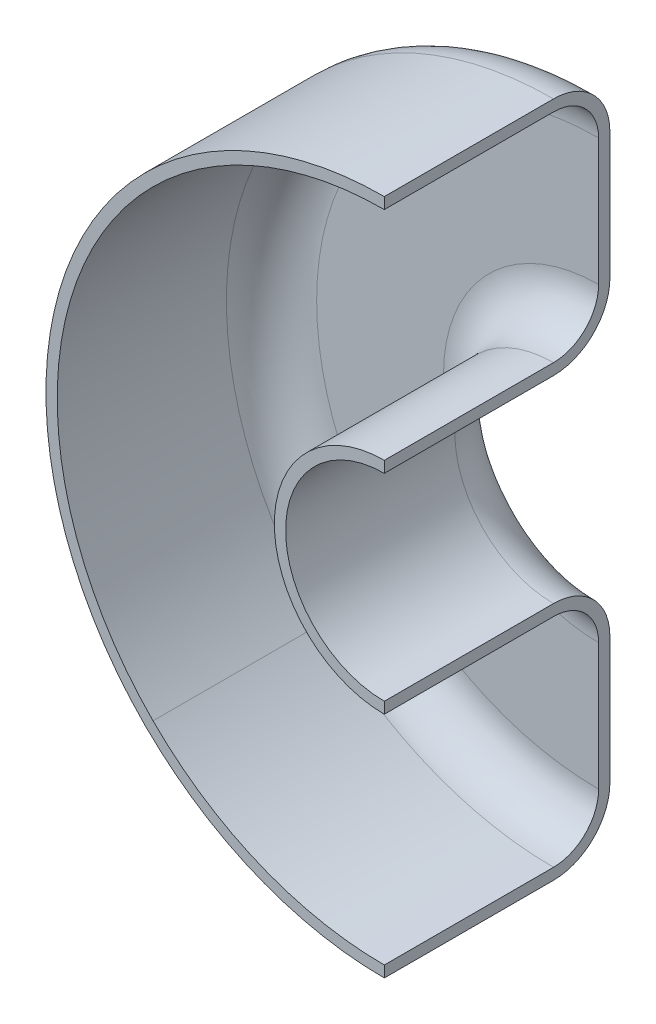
ISO-10303-21;
HEADER;
FILE_DESCRIPTION(('STEP AP214'),'2;1');
FILE_NAME('part.step','',(''),(''),'','','');
FILE_SCHEMA(('AUTOMOTIVE_DESIGN { 1 0 10303 214 1 1 1 1 }'));
ENDSEC;
DATA;
#1=APPLICATION_CONTEXT('core data for automotive mechanical design processes');
#2=APPLICATION_PROTOCOL_DEFINITION('international standard','automotive_design',2000,#1);
#3=PRODUCT_CONTEXT('',#1,'mechanical');
#4=PRODUCT('Part','Part','',(#3));
#5=PRODUCT_RELATED_PRODUCT_CATEGORY('part','',(#4));
#6=PRODUCT_DEFINITION_FORMATION('','',#4);
#7=PRODUCT_DEFINITION_CONTEXT('part definition',#1,'design');
#8=PRODUCT_DEFINITION('design','',#6,#7);
#9=PRODUCT_DEFINITION_SHAPE('','',#8);
#10=(LENGTH_UNIT() NAMED_UNIT(*) SI_UNIT(.MILLI.,.METRE.));
#11=(NAMED_UNIT(*) PLANE_ANGLE_UNIT() SI_UNIT($,.RADIAN.));
#12=(NAMED_UNIT(*) SI_UNIT($,.STERADIAN.) SOLID_ANGLE_UNIT());
#13=UNCERTAINTY_MEASURE_WITH_UNIT(LENGTH_MEASURE(1.E-05),#10,'distance_accuracy_value','');
#14=(GEOMETRIC_REPRESENTATION_CONTEXT(3) GLOBAL_UNCERTAINTY_ASSIGNED_CONTEXT((#13)) GLOBAL_UNIT_ASSIGNED_CONTEXT((#10,
#11,#12)) REPRESENTATION_CONTEXT('',''));
#15=CARTESIAN_POINT('',(0.,0.,0.));
#16=DIRECTION('',(0.,0.,1.));
#17=DIRECTION('',(1.,0.,0.));
#18=AXIS2_PLACEMENT_3D('',#15,#16,#17);
#19=CARTESIAN_POINT('',(0.,0.,40.));
#20=DIRECTION('',(0.,0.,-1.));
#21=DIRECTION('',(-1.,0.,0.));
#22=AXIS2_PLACEMENT_3D('',#19,#20,#21);
#23=CYLINDRICAL_SURFACE('',#22,59.);
#24=DIRECTION('',(0.,0.,-1.));
#25=VECTOR('',#24,1.);
#26=CARTESIAN_POINT('',(-41.7193000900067,-41.7193000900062,40.));
#27=LINE('',#26,#25);
#28=CARTESIAN_POINT('',(-41.7193000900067,-41.7193000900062,10.));
#29=VERTEX_POINT('',#28);
#30=CARTESIAN_POINT('',(-41.7193000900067,-41.7193000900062,40.));
#31=VERTEX_POINT('',#30);
#32=EDGE_CURVE('E13',#29,#31,#27,.F.);
#33=ORIENTED_EDGE('',*,*,#32,.F.);
#34=CARTESIAN_POINT('',(0.,0.,10.));
#35=DIRECTION('',(0.,0.,-1.));
#36=DIRECTION('',(-1.,0.,0.));
#37=AXIS2_PLACEMENT_3D('',#34,#35,#36);
#38=CIRCLE('',#37,59.);
#39=CARTESIAN_POINT('',(-41.719300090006,41.7193000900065,10.));
#40=VERTEX_POINT('',#39);
#41=EDGE_CURVE('E130',#29,#40,#38,.T.);
#42=ORIENTED_EDGE('',*,*,#41,.T.);
#43=DIRECTION('',(0.,0.,-1.));
#44=VECTOR('',#43,1.);
#45=CARTESIAN_POINT('',(-41.719300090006,41.7193000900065,40.));
#46=LINE('',#45,#44);
#47=CARTESIAN_POINT('',(-41.719300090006,41.7193000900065,40.));
#48=VERTEX_POINT('',#47);
#49=EDGE_CURVE('E215',#40,#48,#46,.F.);
#50=ORIENTED_EDGE('',*,*,#49,.T.);
#51=CARTESIAN_POINT('',(0.,0.,40.));
#52=DIRECTION('',(0.,0.,1.));
#53=DIRECTION('',(1.,0.,0.));
#54=AXIS2_PLACEMENT_3D('',#51,#52,#53);
#55=CIRCLE('',#54,59.);
#56=EDGE_CURVE('E60',#48,#31,#55,.T.);
#57=ORIENTED_EDGE('',*,*,#56,.T.);
#58=EDGE_LOOP('',(#33,#42,#50,#57));
#59=FACE_BOUND('',#58,.T.);
#60=ADVANCED_FACE('F52',(#59),#23,.F.);
#61=CARTESIAN_POINT('',(0.,0.,40.));
#62=DIRECTION('',(0.,0.,-1.));
#63=DIRECTION('',(-1.,0.,0.));
#64=AXIS2_PLACEMENT_3D('',#61,#62,#63);
#65=CYLINDRICAL_SURFACE('',#64,59.);
#66=DIRECTION('',(0.,0.,-1.));
#67=VECTOR('',#66,1.);
#68=CARTESIAN_POINT('',(1.31838984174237E-13,-59.,40.));
#69=LINE('',#68,#67);
#70=CARTESIAN_POINT('',(1.31838984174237E-13,-59.,40.));
#71=VERTEX_POINT('',#70);
#72=CARTESIAN_POINT('',(0.,-59.,10.));
#73=VERTEX_POINT('',#72);
#74=EDGE_CURVE('E119',#71,#73,#69,.T.);
#75=ORIENTED_EDGE('',*,*,#74,.T.);
#76=CARTESIAN_POINT('',(0.,0.,10.));
#77=DIRECTION('',(0.,0.,-1.));
#78=DIRECTION('',(-1.,0.,0.));
#79=AXIS2_PLACEMENT_3D('',#76,#77,#78);
#80=CIRCLE('',#79,59.);
#81=EDGE_CURVE('E125',#73,#29,#80,.T.);
#82=ORIENTED_EDGE('',*,*,#81,.T.);
#83=ORIENTED_EDGE('',*,*,#32,.T.);
#84=CARTESIAN_POINT('',(0.,0.,40.));
#85=DIRECTION('',(0.,0.,1.));
#86=DIRECTION('',(1.,0.,0.));
#87=AXIS2_PLACEMENT_3D('',#84,#85,#86);
#88=CIRCLE('',#87,59.);
#89=EDGE_CURVE('E116',#31,#71,#88,.T.);
#90=ORIENTED_EDGE('',*,*,#89,.T.);
#91=EDGE_LOOP('',(#75,#82,#83,#90));
#92=FACE_BOUND('',#91,.T.);
#93=ADVANCED_FACE('F118',(#92),#65,.F.);
#94=CARTESIAN_POINT('',(0.,0.,40.));
#95=DIRECTION('',(0.,0.,-1.));
#96=DIRECTION('',(-1.,0.,0.));
#97=AXIS2_PLACEMENT_3D('',#94,#95,#96);
#98=CYLINDRICAL_SURFACE('',#97,59.);
#99=DIRECTION('',(0.,0.,-1.));
#100=VECTOR('',#99,1.);
#101=CARTESIAN_POINT('',(0.,59.,10.));
#102=LINE('',#101,#100);
#103=CARTESIAN_POINT('',(0.,59.,10.));
#104=VERTEX_POINT('',#103);
#105=CARTESIAN_POINT('',(1.31838984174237E-13,59.,40.));
#106=VERTEX_POINT('',#105);
#107=EDGE_CURVE('E137',#104,#106,#102,.F.);
#108=ORIENTED_EDGE('',*,*,#107,.T.);
#109=CARTESIAN_POINT('',(0.,0.,40.));
#110=DIRECTION('',(0.,0.,1.));
#111=DIRECTION('',(1.,0.,0.));
#112=AXIS2_PLACEMENT_3D('',#109,#110,#111);
#113=CIRCLE('',#112,59.);
#114=EDGE_CURVE('E122',#106,#48,#113,.T.);
#115=ORIENTED_EDGE('',*,*,#114,.T.);
#116=ORIENTED_EDGE('',*,*,#49,.F.);
#117=CARTESIAN_POINT('',(0.,0.,10.));
#118=DIRECTION('',(0.,0.,-1.));
#119=DIRECTION('',(-1.,0.,0.));
#120=AXIS2_PLACEMENT_3D('',#117,#118,#119);
#121=CIRCLE('',#120,59.);
#122=EDGE_CURVE('E204',#40,#104,#121,.T.);
#123=ORIENTED_EDGE('',*,*,#122,.T.);
#124=EDGE_LOOP('',(#108,#115,#116,#123));
#125=FACE_BOUND('',#124,.T.);
#126=ADVANCED_FACE('F244',(#125),#98,.F.);
#127=CARTESIAN_POINT('',(0.,0.,10.));
#128=DIRECTION('',(0.,0.,1.));
#129=DIRECTION('',(1.,0.,0.));
#130=AXIS2_PLACEMENT_3D('',#127,#128,#129);
#131=TOROIDAL_SURFACE('',#130,50.,9.);
#132=CARTESIAN_POINT('',(0.,0.,1.));
#133=DIRECTION('',(0.,0.,1.));
#134=DIRECTION('',(1.,0.,0.));
#135=AXIS2_PLACEMENT_3D('',#132,#133,#134);
#136=CIRCLE('',#135,50.);
#137=CARTESIAN_POINT('',(0.,50.,1.));
#138=VERTEX_POINT('',#137);
#139=CARTESIAN_POINT('',(0.,-50.,1.));
#140=VERTEX_POINT('',#139);
#141=EDGE_CURVE('E200',#138,#140,#136,.T.);
#142=ORIENTED_EDGE('',*,*,#141,.F.);
#143=CARTESIAN_POINT('',(0.,50.,10.));
#144=DIRECTION('',(1.,0.,0.));
#145=DIRECTION('',(0.,0.,-1.));
#146=AXIS2_PLACEMENT_3D('',#143,#144,#145);
#147=CIRCLE('',#146,9.);
#148=EDGE_CURVE('E167',#104,#138,#147,.F.);
#149=ORIENTED_EDGE('',*,*,#148,.F.);
#150=ORIENTED_EDGE('',*,*,#122,.F.);
#151=ORIENTED_EDGE('',*,*,#41,.F.);
#152=ORIENTED_EDGE('',*,*,#81,.F.);
#153=CARTESIAN_POINT('',(0.,-50.,10.));
#154=DIRECTION('',(1.,0.,0.));
#155=DIRECTION('',(0.,0.,-1.));
#156=AXIS2_PLACEMENT_3D('',#153,#154,#155);
#157=CIRCLE('',#156,9.);
#158=EDGE_CURVE('E135',#140,#73,#157,.F.);
#159=ORIENTED_EDGE('',*,*,#158,.F.);
#160=EDGE_LOOP('',(#142,#149,#150,#151,#152,#159));
#161=FACE_BOUND('',#160,.T.);
#162=ADVANCED_FACE('F238',(#161),#131,.F.);
#163=CARTESIAN_POINT('',(0.,0.,1.));
#164=DIRECTION('',(0.,0.,1.));
#165=DIRECTION('',(1.,0.,0.));
#166=AXIS2_PLACEMENT_3D('',#163,#164,#165);
#167=PLANE('',#166);
#168=CARTESIAN_POINT('',(0.,0.,1.));
#169=DIRECTION('',(0.,0.,1.));
#170=DIRECTION('',(1.,0.,0.));
#171=AXIS2_PLACEMENT_3D('',#168,#169,#170);
#172=CIRCLE('',#171,27.5);
#173=CARTESIAN_POINT('',(0.,27.5,1.));
#174=VERTEX_POINT('',#173);
#175=CARTESIAN_POINT('',(0.,-27.5,1.));
#176=VERTEX_POINT('',#175);
#177=EDGE_CURVE('E161',#174,#176,#172,.T.);
#178=ORIENTED_EDGE('',*,*,#177,.F.);
#179=DIRECTION('',(0.,1.,0.));
#180=VECTOR('',#179,1.);
#181=CARTESIAN_POINT('',(0.,0.,1.));
#182=LINE('',#181,#180);
#183=EDGE_CURVE('E162',#174,#138,#182,.T.);
#184=ORIENTED_EDGE('',*,*,#183,.T.);
#185=ORIENTED_EDGE('',*,*,#141,.T.);
#186=DIRECTION('',(0.,1.,0.));
#187=VECTOR('',#186,1.);
#188=CARTESIAN_POINT('',(0.,0.,1.));
#189=LINE('',#188,#187);
#190=EDGE_CURVE('E157',#140,#176,#189,.T.);
#191=ORIENTED_EDGE('',*,*,#190,.T.);
#192=EDGE_LOOP('',(#178,#184,#185,#191));
#193=FACE_BOUND('',#192,.T.);
#194=ADVANCED_FACE('F234',(#193),#167,.T.);
#195=CARTESIAN_POINT('',(0.,0.,10.));
#196=DIRECTION('',(0.,0.,1.));
#197=DIRECTION('',(1.,0.,0.));
#198=AXIS2_PLACEMENT_3D('',#195,#196,#197);
#199=TOROIDAL_SURFACE('',#198,27.5,9.);
#200=CARTESIAN_POINT('',(0.,0.,10.));
#201=DIRECTION('',(0.,0.,1.));
#202=DIRECTION('',(1.,0.,0.));
#203=AXIS2_PLACEMENT_3D('',#200,#201,#202);
#204=CIRCLE('',#203,18.5);
#205=CARTESIAN_POINT('',(0.,18.5,10.));
#206=VERTEX_POINT('',#205);
#207=CARTESIAN_POINT('',(0.,-18.5,10.));
#208=VERTEX_POINT('',#207);
#209=EDGE_CURVE('E55',#206,#208,#204,.T.);
#210=ORIENTED_EDGE('',*,*,#209,.F.);
#211=CARTESIAN_POINT('',(0.,27.5,10.));
#212=DIRECTION('',(1.,0.,0.));
#213=DIRECTION('',(0.,0.,-1.));
#214=AXIS2_PLACEMENT_3D('',#211,#212,#213);
#215=CIRCLE('',#214,9.);
#216=EDGE_CURVE('E152',#174,#206,#215,.F.);
#217=ORIENTED_EDGE('',*,*,#216,.F.);
#218=ORIENTED_EDGE('',*,*,#177,.T.);
#219=CARTESIAN_POINT('',(0.,-27.5,10.));
#220=DIRECTION('',(1.,0.,0.));
#221=DIRECTION('',(0.,0.,-1.));
#222=AXIS2_PLACEMENT_3D('',#219,#220,#221);
#223=CIRCLE('',#222,9.);
#224=EDGE_CURVE('E172',#208,#176,#223,.F.);
#225=ORIENTED_EDGE('',*,*,#224,.F.);
#226=EDGE_LOOP('',(#210,#217,#218,#225));
#227=FACE_BOUND('',#226,.T.);
#228=ADVANCED_FACE('F230',(#227),#199,.F.);
#229=CARTESIAN_POINT('',(0.,0.,0.));
#230=DIRECTION('',(0.,0.,1.));
#231=DIRECTION('',(1.,0.,0.));
#232=AXIS2_PLACEMENT_3D('',#229,#230,#231);
#233=CYLINDRICAL_SURFACE('',#232,18.5);
#234=ORIENTED_EDGE('',*,*,#209,.T.);
#235=DIRECTION('',(0.,0.,1.));
#236=VECTOR('',#235,1.);
#237=CARTESIAN_POINT('',(0.,-18.5,10.));
#238=LINE('',#237,#236);
#239=CARTESIAN_POINT('',(1.31838984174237E-13,-18.5,40.));
#240=VERTEX_POINT('',#239);
#241=EDGE_CURVE('E148',#208,#240,#238,.T.);
#242=ORIENTED_EDGE('',*,*,#241,.T.);
#243=CARTESIAN_POINT('',(0.,0.,40.));
#244=DIRECTION('',(0.,0.,1.));
#245=DIRECTION('',(1.,0.,0.));
#246=AXIS2_PLACEMENT_3D('',#243,#244,#245);
#247=CIRCLE('',#246,18.5);
#248=CARTESIAN_POINT('',(1.31838984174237E-13,18.5,40.));
#249=VERTEX_POINT('',#248);
#250=EDGE_CURVE('E111',#240,#249,#247,.F.);
#251=ORIENTED_EDGE('',*,*,#250,.T.);
#252=DIRECTION('',(0.,0.,1.));
#253=VECTOR('',#252,1.);
#254=CARTESIAN_POINT('',(1.31838984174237E-13,18.5,40.));
#255=LINE('',#254,#253);
#256=EDGE_CURVE('E106',#249,#206,#255,.F.);
#257=ORIENTED_EDGE('',*,*,#256,.T.);
#258=EDGE_LOOP('',(#234,#242,#251,#257));
#259=FACE_BOUND('',#258,.T.);
#260=ADVANCED_FACE('F53',(#259),#233,.T.);
#261=OPEN_SHELL('',(#60,#93,#126,#162,#194,#228,#260));
#262=SHELL_BASED_SURFACE_MODEL('B2',(#261));
#263=CARTESIAN_POINT('',(0.,0.,40.));
#264=DIRECTION('',(0.,0.,-1.));
#265=DIRECTION('',(-1.,0.,0.));
#266=AXIS2_PLACEMENT_3D('',#263,#264,#265);
#267=CYLINDRICAL_SURFACE('',#266,58.);
#268=CARTESIAN_POINT('',(0.,0.,40.));
#269=DIRECTION('',(0.,0.,1.));
#270=DIRECTION('',(1.,0.,0.));
#271=AXIS2_PLACEMENT_3D('',#268,#269,#270);
#272=CIRCLE('',#271,58.);
#273=CARTESIAN_POINT('',(-41.0121933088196,-41.0121933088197,40.));
#274=VERTEX_POINT('',#273);
#275=CARTESIAN_POINT('',(1.31838984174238E-13,-58.,40.));
#276=VERTEX_POINT('',#275);
#277=EDGE_CURVE('E457',#274,#276,#272,.T.);
#278=ORIENTED_EDGE('',*,*,#277,.T.);
#279=DIRECTION('',(0.,0.,-1.));
#280=VECTOR('',#279,1.);
#281=CARTESIAN_POINT('',(1.31838984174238E-13,-58.,40.));
#282=LINE('',#281,#280);
#283=CARTESIAN_POINT('',(0.,-58.,10.));
#284=VERTEX_POINT('',#283);
#285=EDGE_CURVE('E455',#276,#284,#282,.T.);
#286=ORIENTED_EDGE('',*,*,#285,.T.);
#287=CARTESIAN_POINT('',(0.,0.,10.));
#288=DIRECTION('',(0.,0.,-1.));
#289=DIRECTION('',(-1.,0.,0.));
#290=AXIS2_PLACEMENT_3D('',#287,#288,#289);
#291=CIRCLE('',#290,58.);
#292=CARTESIAN_POINT('',(-41.0121933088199,-41.0121933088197,10.));
#293=VERTEX_POINT('',#292);
#294=EDGE_CURVE('E440',#293,#284,#291,.F.);
#295=ORIENTED_EDGE('',*,*,#294,.F.);
#296=DIRECTION('',(0.,0.,-1.));
#297=VECTOR('',#296,1.);
#298=CARTESIAN_POINT('',(-41.0121933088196,-41.0121933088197,40.));
#299=LINE('',#298,#297);
#300=EDGE_CURVE('E475',#293,#274,#299,.F.);
#301=ORIENTED_EDGE('',*,*,#300,.T.);
#302=EDGE_LOOP('',(#278,#286,#295,#301));
#303=FACE_BOUND('',#302,.T.);
#304=ADVANCED_FACE('F325',(#303),#267,.F.);
#305=CARTESIAN_POINT('',(0.,0.,40.));
#306=DIRECTION('',(0.,0.,-1.));
#307=DIRECTION('',(-1.,0.,0.));
#308=AXIS2_PLACEMENT_3D('',#305,#306,#307);
#309=CYLINDRICAL_SURFACE('',#308,60.);
#310=DIRECTION('',(0.,0.,-1.));
#311=VECTOR('',#310,1.);
#312=CARTESIAN_POINT('',(1.31838984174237E-13,-60.,40.));
#313=LINE('',#312,#311);
#314=CARTESIAN_POINT('',(1.31838984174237E-13,-60.,40.));
#315=VERTEX_POINT('',#314);
#316=CARTESIAN_POINT('',(0.,-60.,10.));
#317=VERTEX_POINT('',#316);
#318=EDGE_CURVE('E340',#315,#317,#313,.T.);
#319=ORIENTED_EDGE('',*,*,#318,.F.);
#320=CARTESIAN_POINT('',(0.,0.,40.));
#321=DIRECTION('',(0.,0.,1.));
#322=DIRECTION('',(1.,0.,0.));
#323=AXIS2_PLACEMENT_3D('',#320,#321,#322);
#324=CIRCLE('',#323,60.);
#325=CARTESIAN_POINT('',(-42.4264068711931,-42.4264068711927,40.));
#326=VERTEX_POINT('',#325);
#327=EDGE_CURVE('E499',#326,#315,#324,.T.);
#328=ORIENTED_EDGE('',*,*,#327,.F.);
#329=DIRECTION('',(0.,0.,-1.));
#330=VECTOR('',#329,1.);
#331=CARTESIAN_POINT('',(-42.4264068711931,-42.4264068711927,40.));
#332=LINE('',#331,#330);
#333=CARTESIAN_POINT('',(-42.4264068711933,-42.4264068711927,10.));
#334=VERTEX_POINT('',#333);
#335=EDGE_CURVE('E477',#334,#326,#332,.F.);
#336=ORIENTED_EDGE('',*,*,#335,.F.);
#337=CARTESIAN_POINT('',(0.,0.,10.));
#338=DIRECTION('',(0.,0.,1.));
#339=DIRECTION('',(1.,0.,0.));
#340=AXIS2_PLACEMENT_3D('',#337,#338,#339);
#341=CIRCLE('',#340,60.);
#342=EDGE_CURVE('E486',#334,#317,#341,.T.);
#343=ORIENTED_EDGE('',*,*,#342,.T.);
#344=EDGE_LOOP('',(#319,#328,#336,#343));
#345=FACE_BOUND('',#344,.T.);
#346=ADVANCED_FACE('F556',(#345),#309,.T.);
#347=CARTESIAN_POINT('',(0.,0.,40.));
#348=DIRECTION('',(0.,0.,1.));
#349=DIRECTION('',(1.,0.,0.));
#350=AXIS2_PLACEMENT_3D('',#347,#348,#349);
#351=PLANE('',#350);
#352=CARTESIAN_POINT('',(0.,0.,40.));
#353=DIRECTION('',(0.,0.,1.));
#354=DIRECTION('',(1.,0.,0.));
#355=AXIS2_PLACEMENT_3D('',#352,#353,#354);
#356=CIRCLE('',#355,19.5);
#357=CARTESIAN_POINT('',(0.,19.5,40.));
#358=VERTEX_POINT('',#357);
#359=CARTESIAN_POINT('',(0.,-19.5,40.));
#360=VERTEX_POINT('',#359);
#361=EDGE_CURVE('E503',#358,#360,#356,.T.);
#362=ORIENTED_EDGE('',*,*,#361,.T.);
#363=DIRECTION('',(0.,-1.,0.));
#364=VECTOR('',#363,1.);
#365=CARTESIAN_POINT('',(1.31838984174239E-13,269.210188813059,40.));
#366=LINE('',#365,#364);
#367=CARTESIAN_POINT('',(0.,-17.5,40.));
#368=VERTEX_POINT('',#367);
#369=EDGE_CURVE('E558',#368,#360,#366,.T.);
#370=ORIENTED_EDGE('',*,*,#369,.F.);
#371=CARTESIAN_POINT('',(0.,0.,40.));
#372=DIRECTION('',(0.,0.,1.));
#373=DIRECTION('',(1.,0.,0.));
#374=AXIS2_PLACEMENT_3D('',#371,#372,#373);
#375=CIRCLE('',#374,17.5);
#376=CARTESIAN_POINT('',(0.,17.5,40.));
#377=VERTEX_POINT('',#376);
#378=EDGE_CURVE('E450',#377,#368,#375,.T.);
#379=ORIENTED_EDGE('',*,*,#378,.F.);
#380=EDGE_CURVE('E562',#358,#377,#366,.T.);
#381=ORIENTED_EDGE('',*,*,#380,.F.);
#382=EDGE_LOOP('',(#362,#370,#379,#381));
#383=FACE_BOUND('',#382,.T.);
#384=ADVANCED_FACE('F575',(#383),#351,.T.);
#385=DIRECTION('',(0.,0.,-1.));
#386=VECTOR('',#385,1.);
#387=CARTESIAN_POINT('',(1.31838984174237E-13,60.,40.));
#388=LINE('',#387,#386);
#389=CARTESIAN_POINT('',(0.,60.,10.));
#390=VERTEX_POINT('',#389);
#391=CARTESIAN_POINT('',(1.31838984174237E-13,60.,40.));
#392=VERTEX_POINT('',#391);
#393=EDGE_CURVE('E518',#390,#392,#388,.F.);
#394=ORIENTED_EDGE('',*,*,#393,.F.);
#395=CARTESIAN_POINT('',(-42.4264068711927,42.4264068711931,10.));
#396=VERTEX_POINT('',#395);
#397=EDGE_CURVE('E481',#390,#396,#341,.T.);
#398=ORIENTED_EDGE('',*,*,#397,.T.);
#399=DIRECTION('',(0.,0.,-1.));
#400=VECTOR('',#399,1.);
#401=CARTESIAN_POINT('',(-42.4264068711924,42.4264068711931,40.));
#402=LINE('',#401,#400);
#403=CARTESIAN_POINT('',(-42.4264068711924,42.4264068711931,40.));
#404=VERTEX_POINT('',#403);
#405=EDGE_CURVE('E470',#396,#404,#402,.F.);
#406=ORIENTED_EDGE('',*,*,#405,.T.);
#407=EDGE_CURVE('E496',#392,#404,#324,.T.);
#408=ORIENTED_EDGE('',*,*,#407,.F.);
#409=EDGE_LOOP('',(#394,#398,#406,#408));
#410=FACE_BOUND('',#409,.T.);
#411=ADVANCED_FACE('F595',(#410),#309,.T.);
#412=ORIENTED_EDGE('',*,*,#327,.T.);
#413=EDGE_CURVE('E557',#276,#315,#366,.T.);
#414=ORIENTED_EDGE('',*,*,#413,.F.);
#415=ORIENTED_EDGE('',*,*,#277,.F.);
#416=CARTESIAN_POINT('',(-41.0121933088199,41.01219330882,40.));
#417=VERTEX_POINT('',#416);
#418=EDGE_CURVE('E578',#417,#274,#272,.T.);
#419=ORIENTED_EDGE('',*,*,#418,.F.);
#420=CARTESIAN_POINT('',(1.31838984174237E-13,58.,40.));
#421=VERTEX_POINT('',#420);
#422=EDGE_CURVE('E579',#421,#417,#272,.T.);
#423=ORIENTED_EDGE('',*,*,#422,.F.);
#424=EDGE_CURVE('E348',#392,#421,#366,.T.);
#425=ORIENTED_EDGE('',*,*,#424,.F.);
#426=ORIENTED_EDGE('',*,*,#407,.T.);
#427=EDGE_CURVE('E498',#404,#326,#324,.T.);
#428=ORIENTED_EDGE('',*,*,#427,.T.);
#429=EDGE_LOOP('',(#412,#414,#415,#419,#423,#425,#426,#428));
#430=FACE_BOUND('',#429,.T.);
#431=ADVANCED_FACE('F592',(#430),#351,.T.);
#432=CARTESIAN_POINT('',(0.,0.,0.));
#433=DIRECTION('',(0.,0.,1.));
#434=DIRECTION('',(1.,0.,0.));
#435=AXIS2_PLACEMENT_3D('',#432,#433,#434);
#436=PLANE('',#435);
#437=DIRECTION('',(0.,-1.,0.));
#438=VECTOR('',#437,1.);
#439=CARTESIAN_POINT('',(0.,269.210188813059,0.));
#440=LINE('',#439,#438);
#441=CARTESIAN_POINT('',(0.,-27.5,0.));
#442=VERTEX_POINT('',#441);
#443=CARTESIAN_POINT('',(0.,-50.,0.));
#444=VERTEX_POINT('',#443);
#445=EDGE_CURVE('E563',#442,#444,#440,.T.);
#446=ORIENTED_EDGE('',*,*,#445,.T.);
#447=CARTESIAN_POINT('',(0.,0.,0.));
#448=DIRECTION('',(0.,0.,1.));
#449=DIRECTION('',(1.,0.,0.));
#450=AXIS2_PLACEMENT_3D('',#447,#448,#449);
#451=CIRCLE('',#450,50.);
#452=CARTESIAN_POINT('',(0.,50.,0.));
#453=VERTEX_POINT('',#452);
#454=EDGE_CURVE('E493',#444,#453,#451,.F.);
#455=ORIENTED_EDGE('',*,*,#454,.T.);
#456=CARTESIAN_POINT('',(0.,27.5,0.));
#457=VERTEX_POINT('',#456);
#458=EDGE_CURVE('E559',#453,#457,#440,.T.);
#459=ORIENTED_EDGE('',*,*,#458,.T.);
#460=CARTESIAN_POINT('',(0.,0.,0.));
#461=DIRECTION('',(0.,0.,1.));
#462=DIRECTION('',(1.,0.,0.));
#463=AXIS2_PLACEMENT_3D('',#460,#461,#462);
#464=CIRCLE('',#463,27.5);
#465=EDGE_CURVE('E489',#457,#442,#464,.T.);
#466=ORIENTED_EDGE('',*,*,#465,.T.);
#467=EDGE_LOOP('',(#446,#455,#459,#466));
#468=FACE_BOUND('',#467,.T.);
#469=ADVANCED_FACE('F594',(#468),#436,.F.);
#470=CARTESIAN_POINT('',(0.,0.,0.));
#471=DIRECTION('',(0.,0.,1.));
#472=DIRECTION('',(1.,0.,0.));
#473=AXIS2_PLACEMENT_3D('',#470,#471,#472);
#474=CYLINDRICAL_SURFACE('',#473,17.5);
#475=DIRECTION('',(0.,0.,1.));
#476=VECTOR('',#475,1.);
#477=CARTESIAN_POINT('',(0.,17.5,0.));
#478=LINE('',#477,#476);
#479=CARTESIAN_POINT('',(0.,17.5,10.));
#480=VERTEX_POINT('',#479);
#481=EDGE_CURVE('E571',#377,#480,#478,.F.);
#482=ORIENTED_EDGE('',*,*,#481,.F.);
#483=ORIENTED_EDGE('',*,*,#378,.T.);
#484=DIRECTION('',(0.,0.,1.));
#485=VECTOR('',#484,1.);
#486=CARTESIAN_POINT('',(0.,-17.5,0.));
#487=LINE('',#486,#485);
#488=CARTESIAN_POINT('',(0.,-17.5,10.));
#489=VERTEX_POINT('',#488);
#490=EDGE_CURVE('E523',#489,#368,#487,.T.);
#491=ORIENTED_EDGE('',*,*,#490,.F.);
#492=CARTESIAN_POINT('',(0.,0.,10.));
#493=DIRECTION('',(0.,0.,1.));
#494=DIRECTION('',(1.,0.,0.));
#495=AXIS2_PLACEMENT_3D('',#492,#493,#494);
#496=CIRCLE('',#495,17.5);
#497=EDGE_CURVE('E487',#489,#480,#496,.F.);
#498=ORIENTED_EDGE('',*,*,#497,.T.);
#499=EDGE_LOOP('',(#482,#483,#491,#498));
#500=FACE_BOUND('',#499,.T.);
#501=ADVANCED_FACE('F601',(#500),#474,.F.);
#502=CARTESIAN_POINT('',(0.,0.,10.));
#503=DIRECTION('',(0.,0.,1.));
#504=DIRECTION('',(1.,0.,0.));
#505=AXIS2_PLACEMENT_3D('',#502,#503,#504);
#506=TOROIDAL_SURFACE('',#505,27.5,10.);
#507=ORIENTED_EDGE('',*,*,#465,.F.);
#508=CARTESIAN_POINT('',(0.,27.5,10.));
#509=DIRECTION('',(1.,0.,0.));
#510=DIRECTION('',(0.,0.,-1.));
#511=AXIS2_PLACEMENT_3D('',#508,#509,#510);
#512=CIRCLE('',#511,10.);
#513=EDGE_CURVE('E527',#457,#480,#512,.F.);
#514=ORIENTED_EDGE('',*,*,#513,.T.);
#515=ORIENTED_EDGE('',*,*,#497,.F.);
#516=CARTESIAN_POINT('',(0.,-27.5,10.));
#517=DIRECTION('',(1.,0.,0.));
#518=DIRECTION('',(0.,0.,-1.));
#519=AXIS2_PLACEMENT_3D('',#516,#517,#518);
#520=CIRCLE('',#519,10.);
#521=EDGE_CURVE('E521',#489,#442,#520,.F.);
#522=ORIENTED_EDGE('',*,*,#521,.T.);
#523=EDGE_LOOP('',(#507,#514,#515,#522));
#524=FACE_BOUND('',#523,.T.);
#525=ADVANCED_FACE('F634',(#524),#506,.T.);
#526=CARTESIAN_POINT('',(0.,0.,10.));
#527=DIRECTION('',(0.,0.,1.));
#528=DIRECTION('',(1.,0.,0.));
#529=AXIS2_PLACEMENT_3D('',#526,#527,#528);
#530=TOROIDAL_SURFACE('',#529,50.,10.);
#531=ORIENTED_EDGE('',*,*,#397,.F.);
#532=CARTESIAN_POINT('',(0.,50.,10.));
#533=DIRECTION('',(1.,0.,0.));
#534=DIRECTION('',(0.,0.,-1.));
#535=AXIS2_PLACEMENT_3D('',#532,#533,#534);
#536=CIRCLE('',#535,10.);
#537=EDGE_CURVE('E514',#390,#453,#536,.F.);
#538=ORIENTED_EDGE('',*,*,#537,.T.);
#539=ORIENTED_EDGE('',*,*,#454,.F.);
#540=CARTESIAN_POINT('',(0.,-50.,10.));
#541=DIRECTION('',(1.,0.,0.));
#542=DIRECTION('',(0.,0.,-1.));
#543=AXIS2_PLACEMENT_3D('',#540,#541,#542);
#544=CIRCLE('',#543,10.);
#545=EDGE_CURVE('E515',#444,#317,#544,.F.);
#546=ORIENTED_EDGE('',*,*,#545,.T.);
#547=ORIENTED_EDGE('',*,*,#342,.F.);
#548=EDGE_CURVE('E485',#396,#334,#341,.T.);
#549=ORIENTED_EDGE('',*,*,#548,.F.);
#550=EDGE_LOOP('',(#531,#538,#539,#546,#547,#549));
#551=FACE_BOUND('',#550,.T.);
#552=ADVANCED_FACE('F327',(#551),#530,.T.);
#553=CARTESIAN_POINT('',(0.,58.,10.));
#554=VERTEX_POINT('',#553);
#555=CARTESIAN_POINT('',(-41.0121933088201,41.01219330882,10.));
#556=VERTEX_POINT('',#555);
#557=EDGE_CURVE('E451',#554,#556,#291,.F.);
#558=ORIENTED_EDGE('',*,*,#557,.F.);
#559=DIRECTION('',(0.,0.,-1.));
#560=VECTOR('',#559,1.);
#561=CARTESIAN_POINT('',(1.31838984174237E-13,58.,40.));
#562=LINE('',#561,#560);
#563=EDGE_CURVE('E538',#554,#421,#562,.F.);
#564=ORIENTED_EDGE('',*,*,#563,.T.);
#565=ORIENTED_EDGE('',*,*,#422,.T.);
#566=DIRECTION('',(0.,0.,-1.));
#567=VECTOR('',#566,1.);
#568=CARTESIAN_POINT('',(-41.0121933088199,41.01219330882,40.));
#569=LINE('',#568,#567);
#570=EDGE_CURVE('E467',#556,#417,#569,.F.);
#571=ORIENTED_EDGE('',*,*,#570,.F.);
#572=EDGE_LOOP('',(#558,#564,#565,#571));
#573=FACE_BOUND('',#572,.T.);
#574=ADVANCED_FACE('F611',(#573),#267,.F.);
#575=CARTESIAN_POINT('',(0.,0.,2.));
#576=DIRECTION('',(0.,0.,1.));
#577=DIRECTION('',(1.,0.,0.));
#578=AXIS2_PLACEMENT_3D('',#575,#576,#577);
#579=PLANE('',#578);
#580=CARTESIAN_POINT('',(0.,0.,2.));
#581=DIRECTION('',(0.,0.,1.));
#582=DIRECTION('',(1.,0.,0.));
#583=AXIS2_PLACEMENT_3D('',#580,#581,#582);
#584=CIRCLE('',#583,50.);
#585=CARTESIAN_POINT('',(0.,-50.,2.));
#586=VERTEX_POINT('',#585);
#587=CARTESIAN_POINT('',(0.,50.,2.));
#588=VERTEX_POINT('',#587);
#589=EDGE_CURVE('E581',#586,#588,#584,.F.);
#590=ORIENTED_EDGE('',*,*,#589,.F.);
#591=DIRECTION('',(0.,1.,0.));
#592=VECTOR('',#591,1.);
#593=CARTESIAN_POINT('',(0.,0.,2.));
#594=LINE('',#593,#592);
#595=CARTESIAN_POINT('',(0.,-27.5,2.));
#596=VERTEX_POINT('',#595);
#597=EDGE_CURVE('E461',#586,#596,#594,.T.);
#598=ORIENTED_EDGE('',*,*,#597,.T.);
#599=CARTESIAN_POINT('',(0.,0.,2.));
#600=DIRECTION('',(0.,0.,1.));
#601=DIRECTION('',(1.,0.,0.));
#602=AXIS2_PLACEMENT_3D('',#599,#600,#601);
#603=CIRCLE('',#602,27.5);
#604=CARTESIAN_POINT('',(0.,27.5,2.));
#605=VERTEX_POINT('',#604);
#606=EDGE_CURVE('E583',#605,#596,#603,.T.);
#607=ORIENTED_EDGE('',*,*,#606,.F.);
#608=EDGE_CURVE('E537',#605,#588,#594,.T.);
#609=ORIENTED_EDGE('',*,*,#608,.T.);
#610=EDGE_LOOP('',(#590,#598,#607,#609));
#611=FACE_BOUND('',#610,.T.);
#612=ADVANCED_FACE('F618',(#611),#579,.T.);
#613=CARTESIAN_POINT('',(0.,0.,0.));
#614=DIRECTION('',(0.,0.,1.));
#615=DIRECTION('',(1.,0.,0.));
#616=AXIS2_PLACEMENT_3D('',#613,#614,#615);
#617=CYLINDRICAL_SURFACE('',#616,19.5);
#618=ORIENTED_EDGE('',*,*,#361,.F.);
#619=DIRECTION('',(0.,0.,1.));
#620=VECTOR('',#619,1.);
#621=CARTESIAN_POINT('',(0.,19.5,0.));
#622=LINE('',#621,#620);
#623=CARTESIAN_POINT('',(0.,19.5,10.));
#624=VERTEX_POINT('',#623);
#625=EDGE_CURVE('E542',#358,#624,#622,.F.);
#626=ORIENTED_EDGE('',*,*,#625,.T.);
#627=CARTESIAN_POINT('',(0.,0.,10.));
#628=DIRECTION('',(0.,0.,1.));
#629=DIRECTION('',(1.,0.,0.));
#630=AXIS2_PLACEMENT_3D('',#627,#628,#629);
#631=CIRCLE('',#630,19.5);
#632=CARTESIAN_POINT('',(0.,-19.5,10.));
#633=VERTEX_POINT('',#632);
#634=EDGE_CURVE('E586',#633,#624,#631,.F.);
#635=ORIENTED_EDGE('',*,*,#634,.F.);
#636=DIRECTION('',(0.,0.,1.));
#637=VECTOR('',#636,1.);
#638=CARTESIAN_POINT('',(0.,-19.5,0.));
#639=LINE('',#638,#637);
#640=EDGE_CURVE('E533',#633,#360,#639,.T.);
#641=ORIENTED_EDGE('',*,*,#640,.T.);
#642=EDGE_LOOP('',(#618,#626,#635,#641));
#643=FACE_BOUND('',#642,.T.);
#644=ADVANCED_FACE('F576',(#643),#617,.T.);
#645=CARTESIAN_POINT('',(0.,0.,10.));
#646=DIRECTION('',(0.,0.,1.));
#647=DIRECTION('',(1.,0.,0.));
#648=AXIS2_PLACEMENT_3D('',#645,#646,#647);
#649=TOROIDAL_SURFACE('',#648,27.5,8.);
#650=CARTESIAN_POINT('',(0.,27.5,10.));
#651=DIRECTION('',(1.,0.,0.));
#652=DIRECTION('',(0.,0.,-1.));
#653=AXIS2_PLACEMENT_3D('',#650,#651,#652);
#654=CIRCLE('',#653,8.);
#655=EDGE_CURVE('E540',#605,#624,#654,.F.);
#656=ORIENTED_EDGE('',*,*,#655,.F.);
#657=ORIENTED_EDGE('',*,*,#606,.T.);
#658=CARTESIAN_POINT('',(0.,-27.5,10.));
#659=DIRECTION('',(1.,0.,0.));
#660=DIRECTION('',(0.,0.,-1.));
#661=AXIS2_PLACEMENT_3D('',#658,#659,#660);
#662=CIRCLE('',#661,8.);
#663=EDGE_CURVE('E460',#633,#596,#662,.F.);
#664=ORIENTED_EDGE('',*,*,#663,.F.);
#665=ORIENTED_EDGE('',*,*,#634,.T.);
#666=EDGE_LOOP('',(#656,#657,#664,#665));
#667=FACE_BOUND('',#666,.T.);
#668=ADVANCED_FACE('F625',(#667),#649,.F.);
#669=CARTESIAN_POINT('',(0.,0.,10.));
#670=DIRECTION('',(0.,0.,1.));
#671=DIRECTION('',(1.,0.,0.));
#672=AXIS2_PLACEMENT_3D('',#669,#670,#671);
#673=TOROIDAL_SURFACE('',#672,50.,8.);
#674=CARTESIAN_POINT('',(0.,50.,10.));
#675=DIRECTION('',(1.,0.,0.));
#676=DIRECTION('',(0.,0.,-1.));
#677=AXIS2_PLACEMENT_3D('',#674,#675,#676);
#678=CIRCLE('',#677,8.);
#679=EDGE_CURVE('E50',#554,#588,#678,.F.);
#680=ORIENTED_EDGE('',*,*,#679,.F.);
#681=ORIENTED_EDGE('',*,*,#557,.T.);
#682=EDGE_CURVE('E446',#556,#293,#291,.F.);
#683=ORIENTED_EDGE('',*,*,#682,.T.);
#684=ORIENTED_EDGE('',*,*,#294,.T.);
#685=CARTESIAN_POINT('',(0.,-50.,10.));
#686=DIRECTION('',(1.,0.,0.));
#687=DIRECTION('',(0.,0.,-1.));
#688=AXIS2_PLACEMENT_3D('',#685,#686,#687);
#689=CIRCLE('',#688,8.);
#690=EDGE_CURVE('E333',#586,#284,#689,.F.);
#691=ORIENTED_EDGE('',*,*,#690,.F.);
#692=ORIENTED_EDGE('',*,*,#589,.T.);
#693=EDGE_LOOP('',(#680,#681,#683,#684,#691,#692));
#694=FACE_BOUND('',#693,.T.);
#695=ADVANCED_FACE('F442',(#694),#673,.F.);
#696=ORIENTED_EDGE('',*,*,#682,.F.);
#697=ORIENTED_EDGE('',*,*,#570,.T.);
#698=ORIENTED_EDGE('',*,*,#418,.T.);
#699=ORIENTED_EDGE('',*,*,#300,.F.);
#700=EDGE_LOOP('',(#696,#697,#698,#699));
#701=FACE_BOUND('',#700,.T.);
#702=ADVANCED_FACE('F591',(#701),#267,.F.);
#703=ORIENTED_EDGE('',*,*,#405,.F.);
#704=ORIENTED_EDGE('',*,*,#548,.T.);
#705=ORIENTED_EDGE('',*,*,#335,.T.);
#706=ORIENTED_EDGE('',*,*,#427,.F.);
#707=EDGE_LOOP('',(#703,#704,#705,#706));
#708=FACE_BOUND('',#707,.T.);
#709=ADVANCED_FACE('F606',(#708),#309,.T.);
#710=CARTESIAN_POINT('',(0.,269.210188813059,0.));
#711=DIRECTION('',(1.,0.,0.));
#712=DIRECTION('',(0.,0.,-1.));
#713=AXIS2_PLACEMENT_3D('',#710,#711,#712);
#714=PLANE('',#713);
#715=ORIENTED_EDGE('',*,*,#521,.F.);
#716=ORIENTED_EDGE('',*,*,#490,.T.);
#717=ORIENTED_EDGE('',*,*,#369,.T.);
#718=ORIENTED_EDGE('',*,*,#640,.F.);
#719=ORIENTED_EDGE('',*,*,#663,.T.);
#720=ORIENTED_EDGE('',*,*,#597,.F.);
#721=ORIENTED_EDGE('',*,*,#690,.T.);
#722=ORIENTED_EDGE('',*,*,#285,.F.);
#723=ORIENTED_EDGE('',*,*,#413,.T.);
#724=ORIENTED_EDGE('',*,*,#318,.T.);
#725=ORIENTED_EDGE('',*,*,#545,.F.);
#726=ORIENTED_EDGE('',*,*,#445,.F.);
#727=EDGE_LOOP('',(#715,#716,#717,#718,#719,#720,#721,#722,#723,#724,#725,#726));
#728=FACE_BOUND('',#727,.T.);
#729=ADVANCED_FACE('F465',(#728),#714,.T.);
#730=ORIENTED_EDGE('',*,*,#380,.T.);
#731=ORIENTED_EDGE('',*,*,#481,.T.);
#732=ORIENTED_EDGE('',*,*,#513,.F.);
#733=ORIENTED_EDGE('',*,*,#458,.F.);
#734=ORIENTED_EDGE('',*,*,#537,.F.);
#735=ORIENTED_EDGE('',*,*,#393,.T.);
#736=ORIENTED_EDGE('',*,*,#424,.T.);
#737=ORIENTED_EDGE('',*,*,#563,.F.);
#738=ORIENTED_EDGE('',*,*,#679,.T.);
#739=ORIENTED_EDGE('',*,*,#608,.F.);
#740=ORIENTED_EDGE('',*,*,#655,.T.);
#741=ORIENTED_EDGE('',*,*,#625,.F.);
#742=EDGE_LOOP('',(#730,#731,#732,#733,#734,#735,#736,#737,#738,#739,#740,#741));
#743=FACE_BOUND('',#742,.T.);
#744=ADVANCED_FACE('F569',(#743),#714,.T.);
#745=CLOSED_SHELL('',(#304,#346,#384,#411,#431,#469,#501,#525,#552,#574,#612,#644,#668,#695,
#702,#709,#729,#744));
#746=MANIFOLD_SOLID_BREP('B7',#745);
#747=ADVANCED_BREP_SHAPE_REPRESENTATION('',(#18,#746),#14);
#748=MANIFOLD_SURFACE_SHAPE_REPRESENTATION('',(#18,#262),#14);
#749=SHAPE_REPRESENTATION('',(#18),#14);
#750=SHAPE_DEFINITION_REPRESENTATION(#9,#749);
#751=SHAPE_REPRESENTATION_RELATIONSHIP('','',#749,#747);
#752=SHAPE_REPRESENTATION_RELATIONSHIP('','',#749,#748);
ENDSEC;
END-ISO-10303-21;
